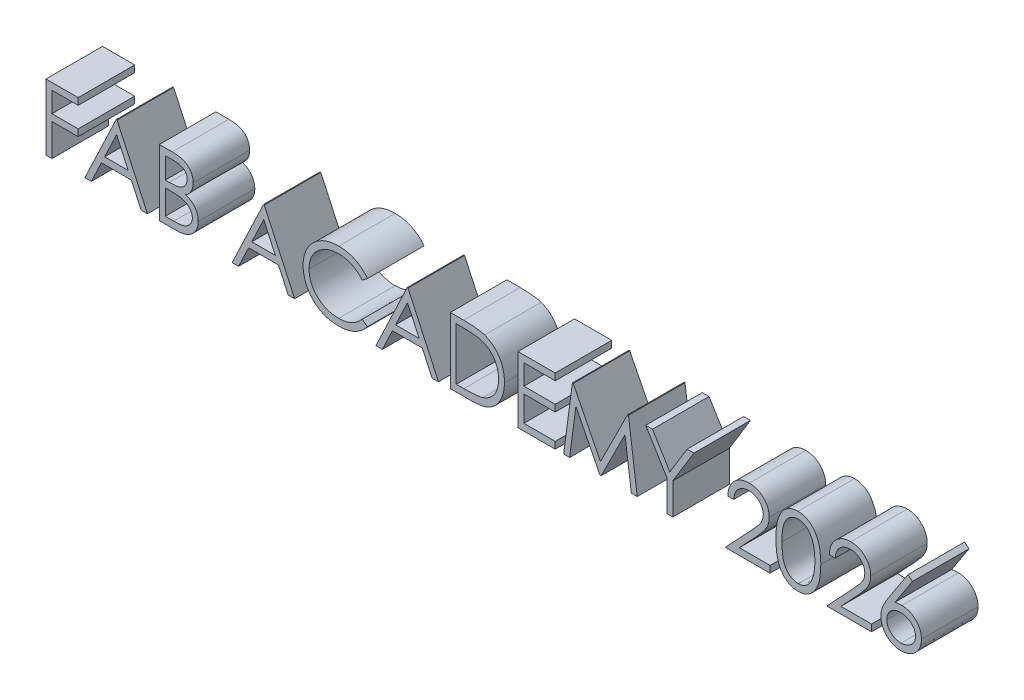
from build123d import *

# Parameters (mm, degrees)
SALIENTE_EXTRUIR1_DEPTH    = 3
SALIENTE_EXTRUIR1_2_DEPTH  = 3
SALIENTE_EXTRUIR1_3_DEPTH  = 3
SALIENTE_EXTRUIR1_4_DEPTH  = 3
SALIENTE_EXTRUIR1_5_DEPTH  = 3
SALIENTE_EXTRUIR1_6_DEPTH  = 3
SALIENTE_EXTRUIR1_7_DEPTH  = 3
SALIENTE_EXTRUIR1_8_DEPTH  = 3
SALIENTE_EXTRUIR1_9_DEPTH  = 3
SALIENTE_EXTRUIR1_10_DEPTH = 3
SALIENTE_EXTRUIR1_11_DEPTH = 3
SALIENTE_EXTRUIR1_12_DEPTH = 3
SALIENTE_EXTRUIR1_13_DEPTH = 3
SALIENTE_EXTRUIR1_14_DEPTH = 3


with BuildPart() as part:
    # Croquis1 → Saliente-Extruir1 (new body)
    with BuildSketch(Plane.XY):
        Polygon((0.448717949, 3.5), (2.153846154, 3.5), (2.153846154, 3.141025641), (0.762820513, 3.141025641), (0.762820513, 2.064102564), (2.153846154, 2.064102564), (2.153846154, 1.705128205), (0.762820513, 1.705128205), (0.762820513, 0), (0.448717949, 0), align=None)
    extrude(amount=SALIENTE_EXTRUIR1_DEPTH)


with BuildPart() as body_2:
    # Croquis1 → Saliente-Extruir1 2 (new body)
    with BuildSketch(Plane.XY):
        Polygon((4.217948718, 3.5), (5.833333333, 0), (5.491887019, 0), (4.974459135, 1.121794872), (3.387820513, 1.121794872), (2.856370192, 0), (2.512820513, 0), (4.173076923, 3.5), align=None)
        Polygon((4.192007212, 2.817107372), (3.558894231, 1.480769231), (4.808994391, 1.480769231), align=None, mode=Mode.SUBTRACT)
    extrude(amount=SALIENTE_EXTRUIR1_2_DEPTH)


with BuildPart() as body_3:
    # Croquis1 → Saliente-Extruir1 3 (new body)
    with BuildSketch(Plane.XY):
        with BuildLine():
            Line((6.461538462, 3.5), (7.14443109, 3.5))
            add(Edge.make_bspline(
                [(7.14443109, 3.5), (7.177859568, 3.49982425), (7.242652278, 3.499483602), (7.33687172, 3.49420047), (7.425120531, 3.486996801), (7.507424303, 3.475566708), (7.583745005, 3.461774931), (7.654312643, 3.445073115), (7.718902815, 3.425046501), (7.796015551, 3.39320022), (7.883936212, 3.345877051), (7.979134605, 3.275948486), (8.060538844, 3.190416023), (8.130725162, 3.093933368), (8.186526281, 2.987797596), (8.226895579, 2.874538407), (8.252453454, 2.755616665), (8.255081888, 2.673973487), (8.256410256, 2.63271234)],
                knots=[0, 0, 0, 0, 1.001505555, 1.941167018, 2.826882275, 3.653841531, 4.429895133, 5.150066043, 5.825578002, 6.45369114, 7.647487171, 8.808567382, 9.977351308, 11.170798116, 12.373658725, 13.556498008, 14.765093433, 16, 16, 16, 16], degree=3))
            add(Edge.make_bspline(
                [(8.256410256, 2.63271234), (8.255317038, 2.594059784), (8.253168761, 2.518103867), (8.232626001, 2.407009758), (8.200465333, 2.301258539), (8.155760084, 2.201236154), (8.097658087, 2.10920254), (8.028799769, 2.024415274), (7.945722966, 1.950464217), (7.883479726, 1.909121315), (7.851862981, 1.888120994)],
                knots=[0, 0, 0, 0, 1.044552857, 2.05264487, 3.044412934, 4.028983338, 5.005914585, 5.980388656, 6.974128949, 8, 8, 8, 8], degree=3))
            add(Edge.make_bspline(
                [(7.851862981, 1.888120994), (7.891623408, 1.872855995), (7.967694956, 1.84365027), (8.072380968, 1.792014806), (8.162575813, 1.735852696), (8.238972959, 1.674520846), (8.304310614, 1.608412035), (8.361363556, 1.536556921), (8.41004493, 1.458018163), (8.451757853, 1.373614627), (8.484306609, 1.284208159), (8.508682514, 1.190637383), (8.522649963, 1.093237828), (8.524637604, 1.026952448), (8.525641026, 0.993489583)],
                knots=[0, 0, 0, 0, 1.27268992, 2.434971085, 3.483601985, 4.442670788, 5.356604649, 6.2567628, 7.179492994, 8.113709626, 9.066344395, 10.018646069, 10.999752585, 12, 12, 12, 12], degree=3))
            add(Edge.make_bspline(
                [(8.525641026, 0.993489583), (8.52466418, 0.959322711), (8.522742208, 0.892098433), (8.508562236, 0.793343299), (8.484553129, 0.698968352), (8.451481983, 0.608363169), (8.408319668, 0.521703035), (8.355791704, 0.438889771), (8.29316014, 0.36075544), (8.223097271, 0.286431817), (8.143835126, 0.21960403), (8.058319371, 0.160088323), (7.965473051, 0.111142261), (7.866821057, 0.070026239), (7.761256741, 0.038619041), (7.649254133, 0.016646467), (7.530909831, 0.00184143), (7.44970008, 0.000624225), (7.408052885, 0)],
                knots=[0, 0, 0, 0, 0.978564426, 1.925352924, 2.850884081, 3.763762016, 4.682927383, 5.618979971, 6.567305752, 7.547517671, 8.540179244, 9.531824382, 10.526200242, 11.540722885, 12.589160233, 13.674978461, 14.80764778, 16, 16, 16, 16], degree=3))
            Line((7.408052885, 0), (6.461538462, 0))
            Line((6.461538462, 0), (6.461538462, 3.5))
        make_face()
        with BuildLine():
            Line((6.775641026, 3.141025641), (6.775641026, 2.019230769))
            Line((6.775641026, 2.019230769), (6.986678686, 2.019230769))
            add(Edge.make_bspline(
                [(6.986678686, 2.019230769), (7.017527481, 2.019630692), (7.077133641, 2.020403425), (7.163453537, 2.022616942), (7.243578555, 2.028814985), (7.317370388, 2.035011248), (7.384712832, 2.045085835), (7.445456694, 2.057077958), (7.500555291, 2.069760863), (7.564094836, 2.09133035), (7.636167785, 2.123208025), (7.713000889, 2.172679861), (7.780735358, 2.231604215), (7.837932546, 2.299595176), (7.884744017, 2.374461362), (7.917257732, 2.455008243), (7.939305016, 2.539228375), (7.941296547, 2.597046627), (7.942307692, 2.626402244)],
                knots=[0, 0, 0, 0, 1.156816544, 2.235205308, 3.236616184, 4.169592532, 5.011045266, 5.787822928, 6.49130361, 7.128639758, 8.301311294, 9.436451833, 10.541879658, 11.654887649, 12.756523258, 13.837046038, 14.901820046, 16, 16, 16, 16], degree=3))
            add(Edge.make_bspline(
                [(7.942307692, 2.626402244), (7.941781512, 2.645828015), (7.940749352, 2.683933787), (7.93229605, 2.739483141), (7.917928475, 2.791726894), (7.899474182, 2.841381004), (7.873685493, 2.886892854), (7.84332203, 2.92983605), (7.80663634, 2.968748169), (7.764879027, 3.005117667), (7.716870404, 3.037362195), (7.662639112, 3.065602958), (7.601451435, 3.088343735), (7.53433858, 3.108259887), (7.460267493, 3.122248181), (7.380092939, 3.133901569), (7.29315822, 3.139834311), (7.233013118, 3.140619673), (7.201923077, 3.141025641)],
                knots=[0, 0, 0, 0, 0.91205012, 1.789085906, 2.630437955, 3.453916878, 4.269457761, 5.079663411, 5.91843418, 6.774407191, 7.675494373, 8.627863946, 9.638891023, 10.736472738, 11.911756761, 13.175263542, 14.539845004, 16, 16, 16, 16], degree=3))
            Line((7.201923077, 3.141025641), (6.775641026, 3.141025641))
        make_face(mode=Mode.SUBTRACT)
        with BuildLine():
            Line((6.775641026, 1.66025641), (6.775641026, 0.358974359))
            Line((6.775641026, 0.358974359), (7.222956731, 0.358974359))
            add(Edge.make_bspline(
                [(7.222956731, 0.358974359), (7.254975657, 0.359358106), (7.316687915, 0.360097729), (7.405789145, 0.362512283), (7.488372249, 0.368004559), (7.564060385, 0.376650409), (7.633670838, 0.386028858), (7.696368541, 0.398640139), (7.752661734, 0.413089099), (7.817936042, 0.435423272), (7.89143955, 0.470119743), (7.970650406, 0.522433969), (8.041076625, 0.584757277), (8.100881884, 0.656888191), (8.149894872, 0.735319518), (8.185550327, 0.818464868), (8.207541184, 0.904950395), (8.210203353, 0.963917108), (8.211538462, 0.993489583)],
                knots=[0, 0, 0, 0, 1.160039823, 2.235823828, 3.228722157, 4.157150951, 4.99529583, 5.772374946, 6.472645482, 7.099169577, 8.269452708, 9.405989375, 10.527446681, 11.663510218, 12.788923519, 13.866172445, 14.929861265, 16, 16, 16, 16], degree=3))
            add(Edge.make_bspline(
                [(8.211538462, 0.993489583), (8.211262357, 1.011982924), (8.210714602, 1.048671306), (8.202453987, 1.102587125), (8.190440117, 1.154812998), (8.174908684, 1.205490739), (8.152289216, 1.253704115), (8.125882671, 1.300406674), (8.09492127, 1.345660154), (8.046677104, 1.402872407), (7.976505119, 1.46878942), (7.876798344, 1.533326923), (7.763426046, 1.58537473), (7.681198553, 1.607474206), (7.638721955, 1.618890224)],
                knots=[0, 0, 0, 0, 0.723448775, 1.435228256, 2.130040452, 2.821711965, 3.505591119, 4.210454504, 4.921174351, 5.648778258, 7.137944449, 8.670945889, 10.280296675, 12, 12, 12, 12], degree=3))
            add(Edge.make_bspline(
                [(7.638721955, 1.618890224), (7.621692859, 1.622345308), (7.584770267, 1.629836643), (7.524562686, 1.637744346), (7.455826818, 1.644789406), (7.37840394, 1.650000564), (7.292196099, 1.655387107), (7.197019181, 1.657481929), (7.093261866, 1.659981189), (7.021269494, 1.660162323), (6.983874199, 1.66025641)],
                knots=[0, 0, 0, 0, 0.634451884, 1.375622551, 2.216452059, 3.157844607, 4.20941857, 5.370758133, 6.634282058, 8, 8, 8, 8], degree=3))
            Line((6.983874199, 1.66025641), (6.775641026, 1.66025641))
        make_face(mode=Mode.SUBTRACT)
    extrude(amount=SALIENTE_EXTRUIR1_3_DEPTH)


with BuildPart() as body_4:
    # Croquis1 → Saliente-Extruir1 4 (new body)
    with BuildSketch(Plane.XY):
        Polygon((12.025641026, 3.5), (13.641025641, 0), (13.299579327, 0), (12.782151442, 1.121794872), (11.195512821, 1.121794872), (10.6640625, 0), (10.320512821, 0), (11.980769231, 3.5), align=None)
        Polygon((11.999699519, 2.817107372), (11.366586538, 1.480769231), (12.616686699, 1.480769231), align=None, mode=Mode.SUBTRACT)
    extrude(amount=SALIENTE_EXTRUIR1_4_DEPTH)


with BuildPart() as body_5:
    # Croquis1 → Saliente-Extruir1 5 (new body)
    with BuildSketch(Plane.XY):
        with BuildLine():
            Line((17.5, 2.857772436), (17.225160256, 2.647435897))
            add(Edge.make_bspline(
                [(17.225160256, 2.647435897), (17.205554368, 2.670801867), (17.166606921, 2.717218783), (17.103947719, 2.782398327), (17.038646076, 2.843463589), (16.970726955, 2.900705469), (16.898967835, 2.952122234), (16.825107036, 3.000393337), (16.747908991, 3.043661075), (16.641157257, 3.096124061), (16.501509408, 3.150870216), (16.325714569, 3.196773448), (16.142203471, 3.225994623), (16.017005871, 3.229159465), (15.953325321, 3.230769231)],
                knots=[0, 0, 0, 0, 0.757959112, 1.505699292, 2.245454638, 2.979532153, 3.711538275, 4.438200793, 5.171680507, 5.909471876, 7.393775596, 8.890124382, 10.418191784, 12, 12, 12, 12], degree=3))
            add(Edge.make_bspline(
                [(15.953325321, 3.230769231), (15.918242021, 3.230365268), (15.848401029, 3.229561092), (15.744752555, 3.218951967), (15.643039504, 3.204040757), (15.543328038, 3.181915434), (15.445745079, 3.153942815), (15.349652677, 3.120517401), (15.256442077, 3.079162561), (15.164823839, 3.033454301), (15.077044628, 2.981826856), (14.99398958, 2.925513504), (14.915961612, 2.865144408), (14.842899, 2.800493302), (14.774727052, 2.731851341), (14.711939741, 2.658487), (14.654754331, 2.580634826), (14.602037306, 2.499321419), (14.554824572, 2.414783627), (14.515294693, 2.326708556), (14.480289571, 2.236604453), (14.452590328, 2.143453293), (14.430665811, 2.047910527), (14.415538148, 1.949719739), (14.405049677, 1.849086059), (14.4042495, 1.780876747), (14.403846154, 1.746494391)],
                knots=[0, 0, 0, 0, 1.054917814, 2.100044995, 3.131103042, 4.146048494, 5.169673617, 6.183595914, 7.203665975, 8.234915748, 9.262203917, 10.264457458, 11.251630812, 12.227803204, 13.197192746, 14.159520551, 15.12972552, 16.100847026, 17.073214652, 18.039054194, 19.002613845, 19.979014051, 20.95965708, 21.949030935, 22.966165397, 24, 24, 24, 24], degree=3))
            add(Edge.make_bspline(
                [(14.403846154, 1.746494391), (14.405107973, 1.694763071), (14.407585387, 1.593195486), (14.429633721, 1.444424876), (14.463138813, 1.301904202), (14.513354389, 1.16652436), (14.57527344, 1.036616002), (14.653514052, 0.914377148), (14.744130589, 0.797960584), (14.848405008, 0.690117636), (14.962810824, 0.591603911), (15.085558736, 0.504853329), (15.216343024, 0.432538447), (15.353719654, 0.3723625), (15.498745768, 0.326105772), (15.65116057, 0.293541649), (15.810632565, 0.272299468), (15.919601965, 0.27026578), (15.975060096, 0.269230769)],
                knots=[0, 0, 0, 0, 1.029171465, 2.020641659, 2.987623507, 3.938342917, 4.889210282, 5.84687017, 6.821220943, 7.821438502, 8.827599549, 9.822697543, 10.807740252, 11.797342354, 12.80366471, 13.83203677, 14.896651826, 16, 16, 16, 16], degree=3))
            add(Edge.make_bspline(
                [(15.975060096, 0.269230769), (16.036162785, 0.270919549), (16.156427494, 0.274243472), (16.33279552, 0.302402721), (16.501631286, 0.348060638), (16.662943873, 0.411958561), (16.816278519, 0.495023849), (16.961875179, 0.595721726), (17.09985675, 0.715010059), (17.182828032, 0.806093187), (17.225160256, 0.852564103)],
                knots=[0, 0, 0, 0, 1.028121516, 2.023589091, 2.998037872, 3.967518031, 4.937445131, 5.927275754, 6.942489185, 8, 8, 8, 8], degree=3))
            Line((17.225160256, 0.852564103), (17.5, 0.644330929))
            add(Edge.make_bspline(
                [(17.5, 0.644330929), (17.47788189, 0.615792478), (17.433751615, 0.558852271), (17.362293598, 0.478580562), (17.2870163, 0.403076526), (17.20736059, 0.332948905), (17.124242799, 0.266794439), (17.036170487, 0.206492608), (16.944301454, 0.151201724), (16.848946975, 0.100574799), (16.750208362, 0.055657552), (16.648203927, 0.017203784), (16.543373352, -0.015921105), (16.435711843, -0.043173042), (16.324996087, -0.064444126), (16.211625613, -0.078663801), (16.095355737, -0.088405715), (16.016914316, -0.089293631), (15.977163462, -0.08974359)],
                knots=[0, 0, 0, 0, 0.986787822, 1.968848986, 2.935600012, 3.899624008, 4.868462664, 5.837806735, 6.815139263, 7.798259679, 8.787526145, 9.778297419, 10.776456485, 11.791383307, 12.812564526, 13.85620153, 14.913611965, 16, 16, 16, 16], degree=3))
            add(Edge.make_bspline(
                [(15.977163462, -0.08974359), (15.939519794, -0.089481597), (15.865084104, -0.088963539), (15.755185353, -0.080571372), (15.648195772, -0.069121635), (15.544421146, -0.051881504), (15.443295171, -0.031537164), (15.345734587, -0.004265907), (15.250779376, 0.026283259), (15.158811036, 0.062188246), (15.069751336, 0.102704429), (14.983887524, 0.148495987), (14.901259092, 0.199177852), (14.821053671, 0.253632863), (14.744456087, 0.313610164), (14.670802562, 0.378276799), (14.599680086, 0.44741481), (14.555677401, 0.497269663), (14.533553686, 0.522335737)],
                knots=[0, 0, 0, 0, 1.114604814, 2.203992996, 3.262667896, 4.300477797, 5.318619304, 6.316056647, 7.298880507, 8.271930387, 9.238335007, 10.195173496, 11.151986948, 12.108099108, 13.064862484, 14.031167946, 15.010108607, 16, 16, 16, 16], degree=3))
            add(Edge.make_bspline(
                [(14.533553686, 0.522335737), (14.498118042, 0.565876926), (14.427674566, 0.652433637), (14.337548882, 0.792719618), (14.260401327, 0.939187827), (14.198025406, 1.092607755), (14.149262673, 1.252635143), (14.115481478, 1.419350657), (14.093529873, 1.592598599), (14.091019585, 1.710435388), (14.08974359, 1.770332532)],
                knots=[0, 0, 0, 0, 0.994628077, 1.977248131, 2.950237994, 3.925870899, 4.908910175, 5.911660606, 6.938484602, 8, 8, 8, 8], degree=3))
            add(Edge.make_bspline(
                [(14.08974359, 1.770332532), (14.091298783, 1.833287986), (14.09435853, 1.95714891), (14.120354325, 2.138922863), (14.162173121, 2.313074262), (14.22157001, 2.479278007), (14.296875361, 2.638408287), (14.389901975, 2.789249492), (14.499569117, 2.932766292), (14.625016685, 3.066781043), (14.76258402, 3.189320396), (14.909902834, 3.297126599), (15.066684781, 3.386844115), (15.231202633, 3.461840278), (15.404688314, 3.519484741), (15.586771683, 3.559837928), (15.777110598, 3.584955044), (15.906973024, 3.588130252), (15.972956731, 3.58974359)],
                knots=[0, 0, 0, 0, 1.032925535, 2.032216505, 3.007276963, 3.968222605, 4.92396291, 5.891752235, 6.871517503, 7.883894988, 8.900124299, 9.891468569, 10.874487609, 11.85992873, 12.854644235, 13.869047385, 14.917252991, 16, 16, 16, 16], degree=3))
            add(Edge.make_bspline(
                [(15.972956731, 3.58974359), (16.013171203, 3.589261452), (16.0927717, 3.588307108), (16.210524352, 3.579000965), (16.325166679, 3.563487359), (16.436777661, 3.542371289), (16.545900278, 3.516163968), (16.651700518, 3.48202367), (16.754799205, 3.442987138), (16.854546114, 3.398028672), (16.950462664, 3.347561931), (17.042518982, 3.292146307), (17.129983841, 3.231850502), (17.213472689, 3.167187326), (17.2915889, 3.096788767), (17.366550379, 3.022591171), (17.435811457, 2.942457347), (17.478564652, 2.886052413), (17.5, 2.857772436)],
                knots=[0, 0, 0, 0, 1.096760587, 2.17092713, 3.219439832, 4.250915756, 5.268269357, 6.278326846, 7.281116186, 8.274029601, 9.260640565, 10.235837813, 11.203064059, 12.156899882, 13.114053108, 14.069676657, 15.032185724, 16, 16, 16, 16], degree=3))
        make_face()
    extrude(amount=SALIENTE_EXTRUIR1_5_DEPTH)


with BuildPart() as body_6:
    # Croquis1 → Saliente-Extruir1 6 (new body)
    with BuildSketch(Plane.XY):
        Polygon((19.653846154, 3.5), (21.269230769, 0), (20.927784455, 0), (20.410356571, 1.121794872), (18.823717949, 1.121794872), (18.292267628, 0), (17.948717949, 0), (19.608974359, 3.5), align=None)
        Polygon((19.627904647, 2.817107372), (18.994791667, 1.480769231), (20.244891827, 1.480769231), align=None, mode=Mode.SUBTRACT)
    extrude(amount=SALIENTE_EXTRUIR1_6_DEPTH)


with BuildPart() as body_7:
    # Croquis1 → Saliente-Extruir1 7 (new body)
    with BuildSketch(Plane.XY):
        with BuildLine():
            Line((21.897435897, 0), (21.897435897, 3.5))
            Line((21.897435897, 3.5), (22.604166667, 3.5))
            add(Edge.make_bspline(
                [(22.604166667, 3.5), (22.665635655, 3.49955743), (22.78439342, 3.498702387), (22.956005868, 3.493280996), (23.11478963, 3.48369053), (23.260222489, 3.469721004), (23.392703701, 3.45256797), (23.511862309, 3.431067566), (23.618314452, 3.405679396), (23.683783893, 3.384033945), (23.71474359, 3.373798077)],
                knots=[0, 0, 0, 0, 1.314313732, 2.53924729, 3.670748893, 4.714932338, 5.66265055, 6.526160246, 7.303039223, 8, 8, 8, 8], degree=3))
            add(Edge.make_bspline(
                [(23.71474359, 3.373798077), (23.755238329, 3.358367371), (23.835309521, 3.327855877), (23.949316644, 3.270299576), (24.056642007, 3.205086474), (24.157861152, 3.132130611), (24.250661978, 3.049366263), (24.338669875, 2.960309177), (24.418284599, 2.861720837), (24.491192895, 2.755645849), (24.556928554, 2.643333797), (24.614067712, 2.524998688), (24.661521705, 2.40124148), (24.700914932, 2.272406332), (24.731961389, 2.138209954), (24.753143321, 1.998496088), (24.767114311, 1.853816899), (24.768518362, 1.755642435), (24.769230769, 1.705829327)],
                knots=[0, 0, 0, 0, 0.984719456, 1.947108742, 2.898477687, 3.838006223, 4.779231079, 5.722358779, 6.681677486, 7.655904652, 8.64651281, 9.637519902, 10.640069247, 11.656948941, 12.698408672, 13.768548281, 14.867775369, 16, 16, 16, 16], degree=3))
            add(Edge.make_bspline(
                [(24.769230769, 1.705829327), (24.768601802, 1.662568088), (24.767362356, 1.577317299), (24.75623304, 1.451676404), (24.74005672, 1.329762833), (24.715012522, 1.212157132), (24.684610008, 1.097828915), (24.645645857, 0.98799667), (24.601010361, 0.881652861), (24.548960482, 0.780235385), (24.491819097, 0.684152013), (24.430497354, 0.593576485), (24.365060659, 0.509801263), (24.294885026, 0.432572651), (24.220877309, 0.362007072), (24.142552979, 0.297515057), (24.059709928, 0.240358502), (23.972719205, 0.188291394), (23.879043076, 0.142871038), (23.77690721, 0.104441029), (23.665876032, 0.072594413), (23.546222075, 0.046023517), (23.417738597, 0.024946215), (23.280299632, 0.010819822), (23.134116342, 0.00126689), (23.033737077, 0.000430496), (22.982071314, 0)],
                knots=[0, 0, 0, 0, 1.105936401, 2.179363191, 3.223086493, 4.248585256, 5.251745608, 6.245858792, 7.225916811, 8.198733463, 9.158002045, 10.082870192, 10.993790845, 11.873723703, 12.748670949, 13.606408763, 14.465103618, 15.319838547, 16.196477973, 17.123216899, 18.106603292, 19.147568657, 20.255746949, 21.433717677, 22.679120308, 24, 24, 24, 24], degree=3))
            Line((22.982071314, 0), (21.897435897, 0))
        make_face()
        with BuildLine():
            Line((22.211538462, 0.358974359), (22.61328125, 0.358974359))
            add(Edge.make_bspline(
                [(22.61328125, 0.358974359), (22.671009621, 0.359222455), (22.782042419, 0.359699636), (22.941700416, 0.363886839), (23.087579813, 0.370728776), (23.219701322, 0.380303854), (23.337990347, 0.392972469), (23.442694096, 0.407097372), (23.533469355, 0.424694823), (23.588398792, 0.440645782), (23.613782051, 0.448016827)],
                knots=[0, 0, 0, 0, 1.375205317, 2.645023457, 3.804390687, 4.853969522, 5.800190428, 6.637939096, 7.370582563, 8, 8, 8, 8], degree=3))
            add(Edge.make_bspline(
                [(23.613782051, 0.448016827), (23.645730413, 0.459268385), (23.708864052, 0.481502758), (23.799745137, 0.52206042), (23.884502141, 0.570102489), (23.964612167, 0.623504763), (24.038938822, 0.684150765), (24.108362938, 0.750721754), (24.17274474, 0.823556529), (24.231419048, 0.902564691), (24.283927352, 0.987254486), (24.329398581, 1.07679332), (24.369250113, 1.17020013), (24.400528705, 1.268909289), (24.42504429, 1.372038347), (24.442408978, 1.479594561), (24.453223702, 1.591557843), (24.45448515, 1.667709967), (24.455128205, 1.706530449)],
                knots=[0, 0, 0, 0, 0.998632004, 1.973411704, 2.929992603, 3.868527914, 4.809262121, 5.754881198, 6.702106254, 7.672490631, 8.653608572, 9.636854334, 10.631411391, 11.644891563, 12.686317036, 13.754757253, 14.855430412, 16, 16, 16, 16], degree=3))
            add(Edge.make_bspline(
                [(24.455128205, 1.706530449), (24.454614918, 1.747463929), (24.45360656, 1.827878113), (24.44093225, 1.945868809), (24.422410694, 2.059349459), (24.395627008, 2.168327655), (24.361496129, 2.273016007), (24.318901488, 2.372835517), (24.270234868, 2.468840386), (24.212331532, 2.558814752), (24.148915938, 2.643907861), (24.078538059, 2.721862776), (24.00231602, 2.792857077), (23.921081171, 2.857996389), (23.832544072, 2.914660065), (23.738790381, 2.965346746), (23.63844471, 3.008362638), (23.568632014, 3.0312415), (23.533153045, 3.04286859)],
                knots=[0, 0, 0, 0, 1.122418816, 2.205001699, 3.251619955, 4.274784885, 5.280384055, 6.268708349, 7.249350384, 8.229342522, 9.199999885, 10.157847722, 11.105861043, 12.055065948, 13.010012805, 13.98527497, 14.976112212, 16, 16, 16, 16], degree=3))
            add(Edge.make_bspline(
                [(23.533153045, 3.04286859), (23.503801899, 3.050985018), (23.441393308, 3.06824277), (23.339553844, 3.087068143), (23.224938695, 3.103672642), (23.097038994, 3.117730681), (22.956000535, 3.127818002), (22.801714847, 3.135389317), (22.634115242, 3.140495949), (22.517932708, 3.140844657), (22.457632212, 3.141025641)],
                knots=[0, 0, 0, 0, 0.674548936, 1.434276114, 2.292660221, 3.240891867, 4.284742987, 5.42552168, 6.663806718, 8, 8, 8, 8], degree=3))
            Line((22.457632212, 3.141025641), (22.211538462, 3.141025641))
            Line((22.211538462, 3.141025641), (22.211538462, 0.358974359))
        make_face(mode=Mode.SUBTRACT)
    extrude(amount=SALIENTE_EXTRUIR1_7_DEPTH)


with BuildPart() as body_8:
    # Croquis1 → Saliente-Extruir1 8 (new body)
    with BuildSketch(Plane.XY):
        Polygon((25.487179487, 3.5), (27.461538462, 3.5), (27.461538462, 3.141025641), (25.801282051, 3.141025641), (25.801282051, 2.064102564), (27.461538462, 2.064102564), (27.461538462, 1.705128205), (25.801282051, 1.705128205), (25.801282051, 0.358974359), (27.461538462, 0.358974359), (27.461538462, 0), (25.487179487, 0), align=None)
    extrude(amount=SALIENTE_EXTRUIR1_8_DEPTH)


with BuildPart() as body_9:
    # Croquis1 → Saliente-Extruir1 9 (new body)
    with BuildSketch(Plane.XY):
        Polygon((27.91025641, 0), (28.372295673, 3.5), (28.417167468, 3.5), (29.862179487, 0.628205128), (31.302984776, 3.5), (31.347856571, 3.5), (31.814102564, 0), (31.5, 0), (31.163461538, 2.516326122), (29.900741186, 0), (29.829226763, 0), (28.560897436, 2.524038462), (28.22646234, 0), align=None)
    extrude(amount=SALIENTE_EXTRUIR1_9_DEPTH)


with BuildPart() as body_10:
    # Croquis1 → Saliente-Extruir1 10 (new body)
    with BuildSketch(Plane.XY):
        Polygon((32.262820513, 3.5), (32.622495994, 3.5), (33.540965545, 1.997495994), (34.460136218, 3.5), (34.820512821, 3.5), (33.698717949, 1.663762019), (33.698717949, 0), (33.384615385, 0), (33.384615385, 1.663762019), align=None)
    extrude(amount=SALIENTE_EXTRUIR1_10_DEPTH)


with BuildPart() as body_11:
    # Croquis1 → Saliente-Extruir1 11 (new body)
    with BuildSketch(Plane.XY):
        with BuildLine():
            Line((36.929487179, 2.423076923), (36.615384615, 2.423076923))
            add(Edge.make_bspline(
                [(36.615384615, 2.423076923), (36.617431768, 2.464747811), (36.621452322, 2.546588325), (36.640280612, 2.665912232), (36.667221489, 2.779967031), (36.705312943, 2.887836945), (36.752619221, 2.990475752), (36.809349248, 3.087475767), (36.876543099, 3.178466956), (36.952749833, 3.262605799), (37.035518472, 3.33979337), (37.124824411, 3.406448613), (37.218669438, 3.462766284), (37.316768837, 3.509847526), (37.420229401, 3.545187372), (37.528112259, 3.571409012), (37.640891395, 3.587185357), (37.717731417, 3.588881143), (37.756810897, 3.58974359)],
                knots=[0, 0, 0, 0, 1.10065271, 2.161652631, 3.183658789, 4.190468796, 5.17591951, 6.163126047, 7.15150782, 8.156236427, 9.156009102, 10.134482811, 11.092018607, 12.041330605, 13.001268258, 13.972401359, 14.968799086, 16, 16, 16, 16], degree=3))
            add(Edge.make_bspline(
                [(37.756810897, 3.58974359), (37.795188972, 3.588845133), (37.870600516, 3.587079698), (37.980662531, 3.571918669), (38.085439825, 3.548173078), (38.184727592, 3.514857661), (38.277733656, 3.470073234), (38.365156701, 3.416275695), (38.448037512, 3.354055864), (38.522644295, 3.28080205), (38.591152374, 3.202599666), (38.65025463, 3.119111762), (38.700867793, 3.032882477), (38.743055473, 2.943254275), (38.774111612, 2.849383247), (38.79768982, 2.752636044), (38.811017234, 2.652011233), (38.813062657, 2.583904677), (38.814102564, 2.549278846)],
                knots=[0, 0, 0, 0, 1.111607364, 2.184268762, 3.212621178, 4.221274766, 5.211760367, 6.196651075, 7.1921475, 8.207485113, 9.220403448, 10.201281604, 11.166441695, 12.114753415, 13.065576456, 14.026450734, 14.996634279, 16, 16, 16, 16], degree=3))
            add(Edge.make_bspline(
                [(38.814102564, 2.549278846), (38.812415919, 2.500529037), (38.809072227, 2.403884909), (38.780216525, 2.261680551), (38.735634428, 2.123775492), (38.681561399, 2.01279644), (38.626940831, 1.923819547), (38.578761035, 1.849903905), (38.521108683, 1.771077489), (38.454511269, 1.68654638), (38.379973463, 1.59605201), (38.296958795, 1.499557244), (38.204833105, 1.398086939), (38.140174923, 1.328781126), (38.106670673, 1.29286859)],
                knots=[0, 0, 0, 0, 1.184203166, 2.347625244, 3.513805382, 4.700623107, 5.337941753, 6.051866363, 6.845199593, 7.711357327, 8.668078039, 9.695487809, 10.805859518, 12, 12, 12, 12], degree=3))
            Line((38.106670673, 1.29286859), (37.230969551, 0.358974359))
            Line((37.230969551, 0.358974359), (38.858974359, 0.358974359))
            Line((38.858974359, 0.358974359), (38.858974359, 0))
            Line((38.858974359, 0), (36.480769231, 0))
            Line((36.480769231, 0), (37.838141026, 1.448517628))
            add(Edge.make_bspline(
                [(37.838141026, 1.448517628), (37.871188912, 1.483015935), (37.93466714, 1.549280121), (38.024449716, 1.646023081), (38.105088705, 1.735772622), (38.177106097, 1.818359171), (38.238939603, 1.894990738), (38.293811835, 1.963185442), (38.337777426, 2.025939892), (38.385492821, 2.098680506), (38.431706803, 2.187492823), (38.471419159, 2.296026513), (38.495634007, 2.407753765), (38.498538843, 2.483255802), (38.5, 2.521233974)],
                knots=[0, 0, 0, 0, 1.329631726, 2.553950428, 3.673215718, 4.687767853, 5.603093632, 6.413772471, 7.123043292, 7.734684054, 8.834405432, 9.900288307, 10.943827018, 12, 12, 12, 12], degree=3))
            add(Edge.make_bspline(
                [(38.5, 2.521233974), (38.499364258, 2.545115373), (38.498111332, 2.592181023), (38.487053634, 2.661186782), (38.470343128, 2.727751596), (38.44639787, 2.792080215), (38.41479113, 2.853525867), (38.37631775, 2.912163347), (38.331927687, 2.968852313), (38.280576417, 3.022005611), (38.224164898, 3.070686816), (38.164570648, 3.113810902), (38.101520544, 3.149850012), (38.035280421, 3.179393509), (37.966034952, 3.202568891), (37.893650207, 3.21862747), (37.818326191, 3.228709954), (37.766892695, 3.230074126), (37.740685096, 3.230769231)],
                knots=[0, 0, 0, 0, 0.991446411, 1.95395049, 2.89581595, 3.838931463, 4.798493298, 5.75982156, 6.748411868, 7.785213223, 8.824556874, 9.840280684, 10.836137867, 11.835679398, 12.848801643, 13.863922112, 14.911575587, 16, 16, 16, 16], degree=3))
            add(Edge.make_bspline(
                [(37.740685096, 3.230769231), (37.713314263, 3.230054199), (37.659562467, 3.228649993), (37.580643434, 3.218827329), (37.505357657, 3.201881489), (37.433515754, 3.178704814), (37.364996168, 3.149246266), (37.300132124, 3.112554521), (37.239069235, 3.068771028), (37.181692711, 3.019130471), (37.128828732, 2.96386287), (37.082381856, 2.902252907), (37.041797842, 2.835425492), (37.006388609, 2.763560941), (36.977632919, 2.686007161), (36.955659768, 2.603039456), (36.938272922, 2.515018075), (36.932464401, 2.45423299), (36.929487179, 2.423076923)],
                knots=[0, 0, 0, 0, 1.031018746, 2.02475058, 2.990194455, 3.934040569, 4.864654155, 5.795059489, 6.735614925, 7.690564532, 8.649604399, 9.611025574, 10.590972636, 11.591080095, 12.624614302, 13.701020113, 14.821632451, 16, 16, 16, 16], degree=3))
        make_face()
    extrude(amount=SALIENTE_EXTRUIR1_11_DEPTH)


with BuildPart() as body_12:
    # Croquis1 → Saliente-Extruir1 12 (new body)
    with BuildSketch(Plane.XY):
        with BuildLine():
            add(Edge.make_bspline(
                [(39.173076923, 1.748597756), (39.173404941, 1.804695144), (39.174042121, 1.913665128), (39.181130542, 2.07244977), (39.192905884, 2.221410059), (39.209043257, 2.360553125), (39.228681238, 2.48991489), (39.254896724, 2.609149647), (39.284709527, 2.718809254), (39.319261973, 2.819251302), (39.358249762, 2.911829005), (39.400684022, 2.998254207), (39.448248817, 3.078396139), (39.49822573, 3.153533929), (39.552637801, 3.222437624), (39.609936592, 3.286080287), (39.672358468, 3.342991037), (39.737781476, 3.394837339), (39.806797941, 3.440286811), (39.877440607, 3.48031955), (39.950195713, 3.514519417), (40.025261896, 3.541409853), (40.101964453, 3.5636207), (40.18057152, 3.578809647), (40.261212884, 3.588366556), (40.315644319, 3.589280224), (40.343249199, 3.58974359)],
                knots=[0, 0, 0, 0, 1.646270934, 3.197905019, 4.663502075, 6.030701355, 7.308322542, 8.50163776, 9.611534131, 10.641858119, 11.616356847, 12.558055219, 13.465016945, 14.349605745, 15.204443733, 16.039544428, 16.859896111, 17.680448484, 18.487036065, 19.28249412, 20.06191084, 20.843045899, 21.620316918, 22.403196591, 23.190181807, 24, 24, 24, 24], degree=3))
            add(Edge.make_bspline(
                [(40.343249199, 3.58974359), (40.371084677, 3.589255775), (40.426440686, 3.588285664), (40.508281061, 3.578961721), (40.588230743, 3.563490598), (40.665948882, 3.541569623), (40.742073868, 3.514373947), (40.816010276, 3.48028683), (40.888217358, 3.440607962), (40.957547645, 3.393984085), (41.02476226, 3.342001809), (41.088210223, 3.28323914), (41.147897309, 3.218289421), (41.204572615, 3.147847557), (41.256628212, 3.070562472), (41.306201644, 2.987778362), (41.35057368, 2.898047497), (41.393308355, 2.80286703), (41.430195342, 2.699603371), (41.463461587, 2.58883861), (41.490340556, 2.469264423), (41.512729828, 2.341508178), (41.530074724, 2.205100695), (41.542707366, 2.060334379), (41.549380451, 1.907113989), (41.550637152, 1.80235614), (41.551282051, 1.748597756)],
                knots=[0, 0, 0, 0, 0.810914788, 1.612654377, 2.396697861, 3.181598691, 3.963628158, 4.749916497, 5.551656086, 6.361998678, 7.18212741, 8.025565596, 8.878627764, 9.750805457, 10.657531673, 11.591944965, 12.560506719, 13.57287815, 14.630710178, 15.753379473, 16.941251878, 18.199788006, 19.531962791, 20.947069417, 22.433333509, 24, 24, 24, 24], degree=3))
            add(Edge.make_bspline(
                [(41.551282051, 1.748597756), (41.550630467, 1.695073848), (41.549360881, 1.590784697), (41.542782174, 1.438253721), (41.529823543, 1.294255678), (41.513613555, 1.158445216), (41.491162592, 1.031387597), (41.463557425, 0.912643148), (41.432907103, 0.801699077), (41.395072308, 0.699464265), (41.353661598, 0.604512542), (41.308606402, 0.515845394), (41.260336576, 0.432679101), (41.207747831, 0.355679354), (41.151694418, 0.284300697), (41.090976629, 0.219803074), (41.027306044, 0.160632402), (40.959893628, 0.107980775), (40.889482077, 0.06189597), (40.817523, 0.02068212), (40.742739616, -0.012550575), (40.666826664, -0.041085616), (40.588698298, -0.062886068), (40.508451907, -0.077959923), (40.426495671, -0.088531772), (40.371094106, -0.089338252), (40.343249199, -0.08974359)],
                knots=[0, 0, 0, 0, 1.561518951, 3.042555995, 4.452378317, 5.7783523, 7.031515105, 8.214008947, 9.334062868, 10.386615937, 11.391082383, 12.354592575, 13.286541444, 14.194233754, 15.072674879, 15.931287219, 16.775624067, 17.606195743, 18.42308326, 19.229000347, 20.022332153, 20.807536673, 21.593273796, 22.3848459, 23.188221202, 24, 24, 24, 24], degree=3))
            add(Edge.make_bspline(
                [(40.343249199, -0.08974359), (40.315645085, -0.089277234), (40.26121516, -0.088357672), (40.180562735, -0.078843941), (40.102280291, -0.063548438), (40.025981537, -0.042131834), (39.951275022, -0.015916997), (39.879178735, 0.018236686), (39.808891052, 0.057570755), (39.740599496, 0.102366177), (39.675587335, 0.15368786), (39.613488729, 0.210452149), (39.55586371, 0.27407556), (39.502229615, 0.343553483), (39.451255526, 0.418246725), (39.404366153, 0.499175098), (39.360995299, 0.586017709), (39.321351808, 0.67933562), (39.286203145, 0.780490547), (39.255155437, 0.890639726), (39.230641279, 1.010755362), (39.209658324, 1.139872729), (39.192733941, 1.278546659), (39.181179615, 1.426852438), (39.1740383, 1.584697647), (39.17340323, 1.692967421), (39.173076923, 1.748597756)],
                knots=[0, 0, 0, 0, 0.810891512, 1.598919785, 2.382837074, 3.152667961, 3.926044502, 4.706494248, 5.493654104, 6.291793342, 7.103789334, 7.925228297, 8.761435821, 9.622817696, 10.50288917, 11.416980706, 12.369136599, 13.353924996, 14.394355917, 15.514179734, 16.714354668, 17.994756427, 19.357759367, 20.818452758, 22.365282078, 24, 24, 24, 24], degree=3))
        make_face()
        with BuildLine():
            add(Edge.make_bspline(
                [(39.487179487, 1.75), (39.487298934, 1.703251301), (39.487530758, 1.612521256), (39.493586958, 1.480677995), (39.50183719, 1.357707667), (39.512478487, 1.24345413), (39.528281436, 1.138304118), (39.545988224, 1.041534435), (39.567536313, 0.953657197), (39.593031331, 0.874069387), (39.622070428, 0.801420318), (39.653776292, 0.733819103), (39.687837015, 0.670467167), (39.725956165, 0.611933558), (39.767471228, 0.558027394), (39.811444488, 0.507794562), (39.859517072, 0.462997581), (39.926020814, 0.409270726), (40.013817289, 0.353751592), (40.124437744, 0.305405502), (40.238106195, 0.275023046), (40.315257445, 0.27115929), (40.353766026, 0.269230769)],
                knots=[0, 0, 0, 0, 1.459021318, 2.831673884, 4.118529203, 5.306027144, 6.411944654, 7.436330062, 8.375795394, 9.233974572, 10.042671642, 10.816086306, 11.563610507, 12.285937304, 12.993564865, 13.685989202, 14.367179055, 15.041617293, 16.353048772, 17.594441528, 18.799311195, 20, 20, 20, 20], degree=3))
            add(Edge.make_bspline(
                [(40.353766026, 0.269230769), (40.392523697, 0.27082855), (40.46995902, 0.274020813), (40.583092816, 0.30481955), (40.692923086, 0.35128909), (40.778995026, 0.406236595), (40.844477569, 0.458564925), (40.89139456, 0.503179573), (40.934456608, 0.55313544), (40.975298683, 0.607034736), (41.012757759, 0.66590722), (41.046820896, 0.729469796), (41.077904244, 0.797898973), (41.09561329, 0.845668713), (41.104667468, 0.870092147)],
                knots=[0, 0, 0, 0, 1.353760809, 2.704726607, 4.075137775, 5.516104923, 6.260822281, 7.007110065, 7.778089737, 8.566572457, 9.372053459, 10.217411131, 11.088608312, 12, 12, 12, 12], degree=3))
            add(Edge.make_bspline(
                [(41.104667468, 0.870092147), (41.115219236, 0.901321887), (41.13664385, 0.964731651), (41.164255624, 1.063095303), (41.186001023, 1.166298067), (41.205564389, 1.273723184), (41.218917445, 1.386162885), (41.229665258, 1.503269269), (41.235995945, 1.625130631), (41.236780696, 1.707925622), (41.237179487, 1.75)],
                knots=[0, 0, 0, 0, 0.884706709, 1.796334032, 2.740027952, 3.714592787, 4.726048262, 5.777819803, 6.87074269, 8, 8, 8, 8], degree=3))
            add(Edge.make_bspline(
                [(41.237179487, 1.75), (41.236629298, 1.792067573), (41.23555301, 1.874360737), (41.231439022, 1.994878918), (41.220815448, 2.109346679), (41.209016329, 2.218257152), (41.191619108, 2.321007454), (41.172861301, 2.418457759), (41.147660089, 2.509400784), (41.120740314, 2.595260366), (41.089929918, 2.675061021), (41.056014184, 2.749174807), (41.019792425, 2.817959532), (40.980450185, 2.881226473), (40.938454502, 2.939259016), (40.892696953, 2.990893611), (40.84499258, 3.037730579), (40.778175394, 3.091193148), (40.690701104, 3.145704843), (40.581855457, 3.195870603), (40.468584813, 3.224678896), (40.392011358, 3.228740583), (40.353766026, 3.230769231)],
                knots=[0, 0, 0, 0, 1.31362396, 2.569729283, 3.763502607, 4.902122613, 5.988968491, 7.01645872, 7.998833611, 8.933434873, 9.825090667, 10.667526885, 11.477055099, 12.250526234, 12.991942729, 13.710640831, 14.402115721, 15.076753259, 16.378508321, 17.609869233, 18.806226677, 20, 20, 20, 20], degree=3))
            add(Edge.make_bspline(
                [(40.353766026, 3.230769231), (40.315055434, 3.228737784), (40.237563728, 3.22467119), (40.123115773, 3.195977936), (40.013411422, 3.14596497), (39.926168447, 3.091012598), (39.85930466, 3.038674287), (39.812221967, 2.993287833), (39.768075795, 2.943641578), (39.727408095, 2.889239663), (39.689318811, 2.830774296), (39.654337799, 2.767785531), (39.622820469, 2.699954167), (39.593735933, 2.627337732), (39.568163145, 2.547756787), (39.547069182, 2.459987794), (39.527582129, 2.363525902), (39.51378686, 2.257806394), (39.501523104, 2.14352424), (39.493641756, 2.020246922), (39.487510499, 1.888182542), (39.487292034, 1.796983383), (39.487179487, 1.75)],
                knots=[0, 0, 0, 0, 1.207732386, 2.417664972, 3.655092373, 4.956220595, 5.625982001, 6.301752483, 6.994047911, 7.697131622, 8.419323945, 9.170223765, 9.943494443, 10.752040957, 11.610060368, 12.549350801, 13.567764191, 14.679664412, 15.874934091, 17.154273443, 18.533957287, 20, 20, 20, 20], degree=3))
        make_face(mode=Mode.SUBTRACT)
    extrude(amount=SALIENTE_EXTRUIR1_12_DEPTH)


with BuildPart() as body_13:
    # Croquis1 → Saliente-Extruir1 13 (new body)
    with BuildSketch(Plane.XY):
        with BuildLine():
            Line((42.314102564, 2.423076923), (42, 2.423076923))
            add(Edge.make_bspline(
                [(42, 2.423076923), (42.002047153, 2.464747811), (42.006067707, 2.546588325), (42.024895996, 2.665912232), (42.051836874, 2.779967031), (42.089928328, 2.887836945), (42.137234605, 2.990475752), (42.193964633, 3.087475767), (42.261158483, 3.178466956), (42.337365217, 3.262605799), (42.420133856, 3.33979337), (42.509439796, 3.406448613), (42.603284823, 3.462766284), (42.701384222, 3.509847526), (42.804844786, 3.545187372), (42.912727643, 3.571409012), (43.02550678, 3.587185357), (43.102346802, 3.588881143), (43.141426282, 3.58974359)],
                knots=[0, 0, 0, 0, 1.10065271, 2.161652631, 3.183658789, 4.190468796, 5.17591951, 6.163126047, 7.15150782, 8.156236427, 9.156009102, 10.134482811, 11.092018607, 12.041330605, 13.001268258, 13.972401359, 14.968799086, 16, 16, 16, 16], degree=3))
            add(Edge.make_bspline(
                [(43.141426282, 3.58974359), (43.179804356, 3.588845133), (43.255215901, 3.587079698), (43.365277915, 3.571918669), (43.47005521, 3.548173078), (43.569342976, 3.514857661), (43.662349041, 3.470073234), (43.749772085, 3.416275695), (43.832652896, 3.354055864), (43.90725968, 3.28080205), (43.975767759, 3.202599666), (44.034870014, 3.119111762), (44.085483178, 3.032882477), (44.127670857, 2.943254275), (44.158726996, 2.849383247), (44.182305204, 2.752636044), (44.195632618, 2.652011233), (44.197678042, 2.583904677), (44.198717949, 2.549278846)],
                knots=[0, 0, 0, 0, 1.111607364, 2.184268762, 3.212621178, 4.221274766, 5.211760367, 6.196651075, 7.1921475, 8.207485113, 9.220403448, 10.201281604, 11.166441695, 12.114753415, 13.065576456, 14.026450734, 14.996634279, 16, 16, 16, 16], degree=3))
            add(Edge.make_bspline(
                [(44.198717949, 2.549278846), (44.197031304, 2.500529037), (44.193687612, 2.403884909), (44.164831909, 2.261680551), (44.120249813, 2.123775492), (44.066176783, 2.01279644), (44.011556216, 1.923819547), (43.96337642, 1.849903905), (43.905724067, 1.771077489), (43.839126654, 1.68654638), (43.764588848, 1.59605201), (43.68157418, 1.499557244), (43.589448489, 1.398086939), (43.524790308, 1.328781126), (43.491286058, 1.29286859)],
                knots=[0, 0, 0, 0, 1.184203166, 2.347625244, 3.513805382, 4.700623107, 5.337941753, 6.051866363, 6.845199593, 7.711357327, 8.668078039, 9.695487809, 10.805859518, 12, 12, 12, 12], degree=3))
            Line((43.491286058, 1.29286859), (42.615584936, 0.358974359))
            Line((42.615584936, 0.358974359), (44.243589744, 0.358974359))
            Line((44.243589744, 0.358974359), (44.243589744, 0))
            Line((44.243589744, 0), (41.865384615, 0))
            Line((41.865384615, 0), (43.22275641, 1.448517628))
            add(Edge.make_bspline(
                [(43.22275641, 1.448517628), (43.255804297, 1.483015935), (43.319282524, 1.549280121), (43.409065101, 1.646023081), (43.489704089, 1.735772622), (43.561721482, 1.818359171), (43.623554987, 1.894990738), (43.678427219, 1.963185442), (43.72239281, 2.025939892), (43.770108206, 2.098680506), (43.816322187, 2.187492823), (43.856034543, 2.296026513), (43.880249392, 2.407753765), (43.883154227, 2.483255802), (43.884615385, 2.521233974)],
                knots=[0, 0, 0, 0, 1.329631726, 2.553950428, 3.673215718, 4.687767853, 5.603093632, 6.413772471, 7.123043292, 7.734684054, 8.834405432, 9.900288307, 10.943827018, 12, 12, 12, 12], degree=3))
            add(Edge.make_bspline(
                [(43.884615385, 2.521233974), (43.883979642, 2.545115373), (43.882726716, 2.592181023), (43.871669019, 2.661186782), (43.854958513, 2.727751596), (43.831013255, 2.792080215), (43.799406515, 2.853525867), (43.760933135, 2.912163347), (43.716543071, 2.968852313), (43.665191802, 3.022005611), (43.608780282, 3.070686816), (43.549186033, 3.113810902), (43.486135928, 3.149850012), (43.419895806, 3.179393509), (43.350650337, 3.202568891), (43.278265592, 3.21862747), (43.202941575, 3.228709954), (43.15150808, 3.230074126), (43.125300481, 3.230769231)],
                knots=[0, 0, 0, 0, 0.991446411, 1.95395049, 2.89581595, 3.838931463, 4.798493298, 5.75982156, 6.748411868, 7.785213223, 8.824556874, 9.840280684, 10.836137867, 11.835679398, 12.848801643, 13.863922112, 14.911575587, 16, 16, 16, 16], degree=3))
            add(Edge.make_bspline(
                [(43.125300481, 3.230769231), (43.097929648, 3.230054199), (43.044177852, 3.228649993), (42.965258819, 3.218827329), (42.889973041, 3.201881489), (42.818131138, 3.178704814), (42.749611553, 3.149246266), (42.684747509, 3.112554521), (42.623684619, 3.068771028), (42.566308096, 3.019130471), (42.513444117, 2.96386287), (42.466997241, 2.902252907), (42.426413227, 2.835425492), (42.391003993, 2.763560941), (42.362248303, 2.686007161), (42.340275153, 2.603039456), (42.322888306, 2.515018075), (42.317079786, 2.45423299), (42.314102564, 2.423076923)],
                knots=[0, 0, 0, 0, 1.031018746, 2.02475058, 2.990194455, 3.934040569, 4.864654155, 5.795059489, 6.735614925, 7.690564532, 8.649604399, 9.611025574, 10.590972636, 11.591080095, 12.624614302, 13.701020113, 14.821632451, 16, 16, 16, 16], degree=3))
        make_face()
    extrude(amount=SALIENTE_EXTRUIR1_13_DEPTH)


with BuildPart() as body_14:
    # Croquis1 → Saliente-Extruir1 14 (new body)
    with BuildSketch(Plane.XY):
        with BuildLine():
            Line((46.173076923, 3.58974359), (46.415665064, 3.399739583))
            Line((46.415665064, 3.399739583), (45.490885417, 1.985576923))
            add(Edge.make_bspline(
                [(45.490885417, 1.985576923), (45.552455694, 1.995390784), (45.67255548, 2.014533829), (45.794121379, 2.017691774), (45.853365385, 2.019230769)],
                knots=[0, 0, 0, 0, 1.025318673, 2, 2, 2, 2], degree=3))
            add(Edge.make_bspline(
                [(45.853365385, 2.019230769), (45.888939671, 2.018288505), (45.95873498, 2.016439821), (46.061289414, 2.001830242), (46.159856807, 1.979090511), (46.254217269, 1.945809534), (46.344490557, 1.903309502), (46.43119287, 1.852370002), (46.512694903, 1.790364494), (46.590046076, 1.721099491), (46.660273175, 1.644382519), (46.72244923, 1.562981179), (46.774676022, 1.476980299), (46.817049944, 1.386423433), (46.849954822, 1.291450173), (46.873942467, 1.192182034), (46.88812206, 1.088550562), (46.890047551, 1.018072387), (46.891025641, 0.982271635)],
                knots=[0, 0, 0, 0, 1.044136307, 2.048553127, 3.035567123, 4.010001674, 4.980053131, 5.96154148, 6.956538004, 7.981742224, 9.006487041, 10.005615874, 10.984750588, 11.954802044, 12.935714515, 13.930994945, 14.949008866, 16, 16, 16, 16], degree=3))
            add(Edge.make_bspline(
                [(46.891025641, 0.982271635), (46.889602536, 0.933291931), (46.886802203, 0.836911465), (46.858898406, 0.696534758), (46.815538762, 0.562802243), (46.753561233, 0.437849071), (46.67657885, 0.321846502), (46.582701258, 0.219061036), (46.475257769, 0.127390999), (46.353770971, 0.05073438), (46.223028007, -0.011868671), (46.08567601, -0.056833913), (45.943048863, -0.084517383), (45.846244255, -0.087987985), (45.797275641, -0.08974359)],
                knots=[0, 0, 0, 0, 1.031375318, 2.029502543, 3.004789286, 3.987476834, 4.960371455, 5.9300674, 6.912260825, 7.929083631, 8.949397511, 9.960523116, 10.96833055, 12, 12, 12, 12], degree=3))
            add(Edge.make_bspline(
                [(45.797275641, -0.08974359), (45.75017894, -0.088215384), (45.656888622, -0.085188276), (45.519655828, -0.058222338), (45.387792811, -0.014515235), (45.26222343, 0.045699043), (45.145902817, 0.121756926), (45.041837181, 0.213319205), (44.950545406, 0.31842867), (44.874570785, 0.437069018), (44.814312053, 0.564558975), (44.769122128, 0.697496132), (44.742725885, 0.835396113), (44.739037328, 0.928877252), (44.737179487, 0.975961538)],
                knots=[0, 0, 0, 0, 1.012016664, 2.004627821, 2.994792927, 3.992885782, 4.990978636, 5.973936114, 6.964471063, 7.975201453, 8.993600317, 9.990122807, 10.98767138, 12, 12, 12, 12], degree=3))
            add(Edge.make_bspline(
                [(44.737179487, 0.975961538), (44.738360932, 1.012006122), (44.740773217, 1.085602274), (44.757616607, 1.197066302), (44.784681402, 1.311117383), (44.814991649, 1.407871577), (44.847017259, 1.487133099), (44.873669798, 1.55103659), (44.906843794, 1.616797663), (44.942217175, 1.686671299), (44.982974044, 1.758856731), (45.027289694, 1.834560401), (45.076389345, 1.912578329), (45.110809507, 1.965522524), (45.128405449, 1.992588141)],
                knots=[0, 0, 0, 0, 1.173818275, 2.396712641, 3.66331629, 4.989737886, 5.693666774, 6.447286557, 7.243889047, 8.091586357, 8.998013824, 9.943181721, 10.948533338, 12, 12, 12, 12], degree=3))
            Line((45.128405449, 1.992588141), (46.173076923, 3.58974359))
        make_face()
        with BuildLine():
            add(Edge.make_bspline(
                [(45.787459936, 1.66025641), (45.760798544, 1.659468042), (45.708489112, 1.65792127), (45.631840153, 1.649185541), (45.559493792, 1.632632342), (45.490618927, 1.611224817), (45.425950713, 1.582060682), (45.364687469, 1.547113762), (45.3075343, 1.505244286), (45.254770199, 1.457978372), (45.206955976, 1.406181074), (45.165773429, 1.350713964), (45.130251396, 1.292899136), (45.10136948, 1.232257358), (45.07887943, 1.168810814), (45.062611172, 1.102851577), (45.053557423, 1.033937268), (45.052051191, 0.987204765), (45.051282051, 0.963341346)],
                knots=[0, 0, 0, 0, 1.128956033, 2.215002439, 3.259141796, 4.2666399, 5.263148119, 6.255916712, 7.247353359, 8.256307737, 9.250603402, 10.226115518, 11.176314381, 12.118911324, 13.063945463, 14.021379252, 14.989639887, 16, 16, 16, 16], degree=3))
            add(Edge.make_bspline(
                [(45.051282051, 0.963341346), (45.051908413, 0.939691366), (45.053136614, 0.893317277), (45.064288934, 0.824978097), (45.081324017, 0.759213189), (45.106664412, 0.69636159), (45.136891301, 0.635465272), (45.176796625, 0.578729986), (45.221013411, 0.522709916), (45.273867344, 0.471708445), (45.330590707, 0.424251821), (45.39119191, 0.382771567), (45.454351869, 0.347285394), (45.520923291, 0.319474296), (45.589961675, 0.296650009), (45.662042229, 0.28058853), (45.737215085, 0.271508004), (45.788137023, 0.26999981), (45.814102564, 0.269230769)],
                knots=[0, 0, 0, 0, 0.989467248, 1.94019797, 2.891935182, 3.827694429, 4.772920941, 5.730924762, 6.725747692, 7.756678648, 8.79901574, 9.819492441, 10.826891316, 11.826466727, 12.835195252, 13.867842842, 14.912794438, 16, 16, 16, 16], degree=3))
            add(Edge.make_bspline(
                [(45.814102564, 0.269230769), (45.840068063, 0.269999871), (45.890989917, 0.271508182), (45.966163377, 0.280587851), (46.038241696, 0.296652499), (46.107288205, 0.31946527), (46.173829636, 0.347318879), (46.236934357, 0.382550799), (46.296962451, 0.424506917), (46.35372305, 0.471627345), (46.406356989, 0.523000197), (46.451634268, 0.578229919), (46.490317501, 0.635923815), (46.521751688, 0.696121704), (46.546812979, 0.759251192), (46.563934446, 0.824967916), (46.575063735, 0.893319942), (46.576295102, 0.939692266), (46.576923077, 0.963341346)],
                knots=[0, 0, 0, 0, 1.087397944, 2.132534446, 3.165364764, 4.174271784, 5.174024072, 6.181601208, 7.194203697, 8.236725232, 9.267838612, 10.269026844, 11.221737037, 12.171628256, 13.107553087, 14.05945871, 15.010357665, 16, 16, 16, 16], degree=3))
            add(Edge.make_bspline(
                [(46.576923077, 0.963341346), (46.576372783, 0.987235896), (46.575292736, 1.034133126), (46.563076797, 1.10282076), (46.546134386, 1.169145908), (46.520551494, 1.232692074), (46.487314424, 1.293207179), (46.446833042, 1.351001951), (46.399992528, 1.406499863), (46.345925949, 1.458111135), (46.287070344, 1.504952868), (46.224889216, 1.547270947), (46.158995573, 1.581735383), (46.090578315, 1.611324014), (46.018813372, 1.632293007), (45.944484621, 1.649237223), (45.86688775, 1.657848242), (45.814118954, 1.659448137), (45.787459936, 1.66025641)],
                knots=[0, 0, 0, 0, 0.978753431, 1.920974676, 2.853199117, 3.782215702, 4.721507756, 5.67862441, 6.671401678, 7.694929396, 8.738190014, 9.75360867, 10.774035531, 11.783329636, 12.805060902, 13.835252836, 14.906360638, 16, 16, 16, 16], degree=3))
        make_face(mode=Mode.SUBTRACT)
    extrude(amount=SALIENTE_EXTRUIR1_14_DEPTH)


solid = Compound([part.part, body_2.part, body_3.part, body_4.part, body_5.part, body_6.part, body_7.part, body_8.part, body_9.part, body_10.part, body_11.part, body_12.part, body_13.part, body_14.part])
